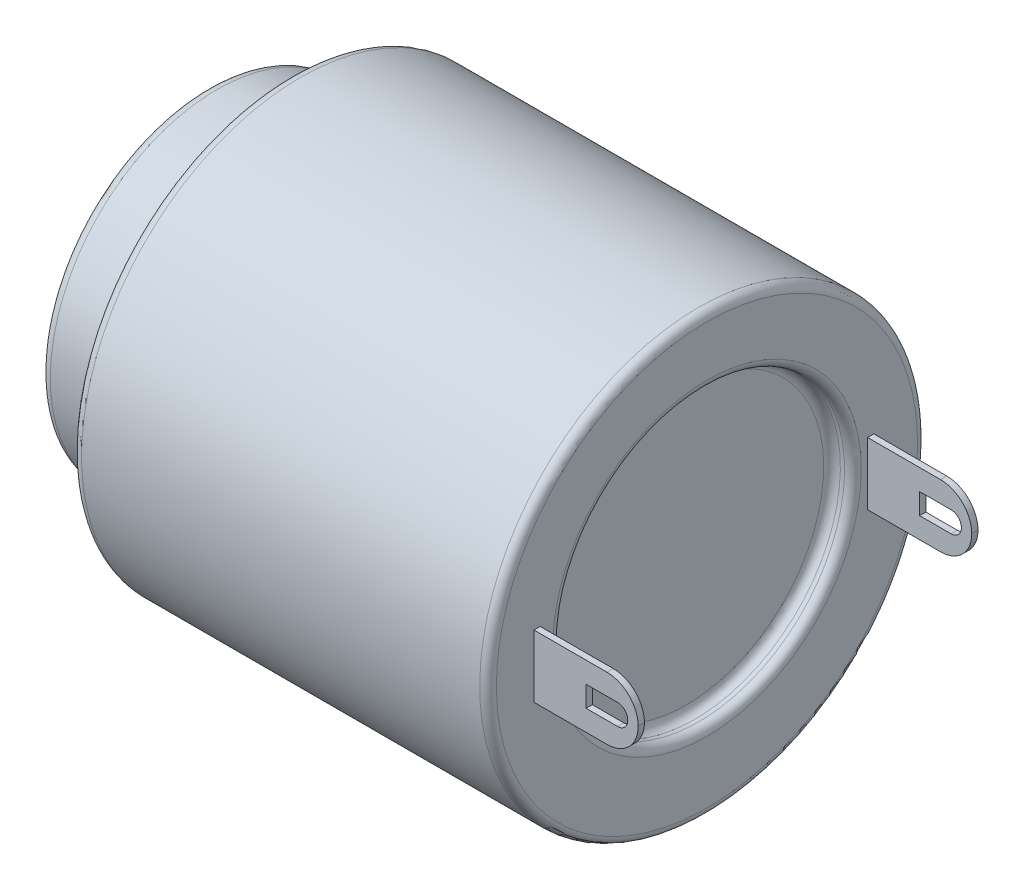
ISO-10303-21;
HEADER;
FILE_DESCRIPTION(('STEP AP214'),'2;1');
FILE_NAME('part.step','',(''),(''),'','','');
FILE_SCHEMA(('AUTOMOTIVE_DESIGN { 1 0 10303 214 1 1 1 1 }'));
ENDSEC;
DATA;
#1=APPLICATION_CONTEXT('core data for automotive mechanical design processes');
#2=APPLICATION_PROTOCOL_DEFINITION('international standard','automotive_design',2000,#1);
#3=PRODUCT_CONTEXT('',#1,'mechanical');
#4=PRODUCT('Part','Part','',(#3));
#5=PRODUCT_RELATED_PRODUCT_CATEGORY('part','',(#4));
#6=PRODUCT_DEFINITION_FORMATION('','',#4);
#7=PRODUCT_DEFINITION_CONTEXT('part definition',#1,'design');
#8=PRODUCT_DEFINITION('design','',#6,#7);
#9=PRODUCT_DEFINITION_SHAPE('','',#8);
#10=(LENGTH_UNIT() NAMED_UNIT(*) SI_UNIT(.MILLI.,.METRE.));
#11=(NAMED_UNIT(*) PLANE_ANGLE_UNIT() SI_UNIT($,.RADIAN.));
#12=(NAMED_UNIT(*) SI_UNIT($,.STERADIAN.) SOLID_ANGLE_UNIT());
#13=UNCERTAINTY_MEASURE_WITH_UNIT(LENGTH_MEASURE(1.E-05),#10,'distance_accuracy_value','');
#14=(GEOMETRIC_REPRESENTATION_CONTEXT(3) GLOBAL_UNCERTAINTY_ASSIGNED_CONTEXT((#13)) GLOBAL_UNIT_ASSIGNED_CONTEXT((#10,
#11,#12)) REPRESENTATION_CONTEXT('',''));
#15=CARTESIAN_POINT('',(0.,0.,0.));
#16=DIRECTION('',(0.,0.,1.));
#17=DIRECTION('',(1.,0.,0.));
#18=AXIS2_PLACEMENT_3D('',#15,#16,#17);
#19=CARTESIAN_POINT('',(-48.9266761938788,22.2309872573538,0.));
#20=DIRECTION('',(1.,0.,0.));
#21=DIRECTION('',(0.,1.,0.));
#22=AXIS2_PLACEMENT_3D('',#19,#20,#21);
#23=PLANE('',#22);
#24=CARTESIAN_POINT('',(-48.9266761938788,11.7309872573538,0.));
#25=DIRECTION('',(1.,0.,0.));
#26=DIRECTION('',(0.,1.,0.));
#27=AXIS2_PLACEMENT_3D('',#24,#25,#26);
#28=CIRCLE('',#27,10.1);
#29=CARTESIAN_POINT('',(-48.9266761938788,21.8309872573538,0.));
#30=VERTEX_POINT('',#29);
#31=EDGE_CURVE('E360',#30,#30,#28,.T.);
#32=ORIENTED_EDGE('',*,*,#31,.T.);
#33=EDGE_LOOP('',(#32));
#34=FACE_BOUND('',#33,.T.);
#35=CARTESIAN_POINT('',(-48.9266761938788,12.0060855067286,0.));
#36=DIRECTION('',(1.,0.,0.));
#37=DIRECTION('',(0.,1.,0.));
#38=AXIS2_PLACEMENT_3D('',#35,#36,#37);
#39=CIRCLE('',#38,7.4);
#40=CARTESIAN_POINT('',(-48.9266761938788,19.4060855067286,0.));
#41=VERTEX_POINT('',#40);
#42=EDGE_CURVE('E357',#41,#41,#39,.F.);
#43=ORIENTED_EDGE('',*,*,#42,.T.);
#44=EDGE_LOOP('',(#43));
#45=FACE_BOUND('',#44,.T.);
#46=DIRECTION('',(0.,0.,-1.));
#47=VECTOR('',#46,1.);
#48=CARTESIAN_POINT('',(-48.9266761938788,10.1746732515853,8.3));
#49=LINE('',#48,#47);
#50=CARTESIAN_POINT('',(-48.9266761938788,10.1746732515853,8.3));
#51=VERTEX_POINT('',#50);
#52=CARTESIAN_POINT('',(-48.9266761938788,10.1746732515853,8.));
#53=VERTEX_POINT('',#52);
#54=EDGE_CURVE('E283',#51,#53,#49,.T.);
#55=ORIENTED_EDGE('',*,*,#54,.F.);
#56=DIRECTION('',(0.,-1.,0.));
#57=VECTOR('',#56,1.);
#58=CARTESIAN_POINT('',(-48.9266761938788,13.1746732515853,8.3));
#59=LINE('',#58,#57);
#60=CARTESIAN_POINT('',(-48.9266761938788,13.1746732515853,8.3));
#61=VERTEX_POINT('',#60);
#62=EDGE_CURVE('E280',#61,#51,#59,.T.);
#63=ORIENTED_EDGE('',*,*,#62,.F.);
#64=DIRECTION('',(0.,0.,1.));
#65=VECTOR('',#64,1.);
#66=CARTESIAN_POINT('',(-48.9266761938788,13.1746732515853,8.3));
#67=LINE('',#66,#65);
#68=CARTESIAN_POINT('',(-48.9266761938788,13.1746732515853,8.));
#69=VERTEX_POINT('',#68);
#70=EDGE_CURVE('E289',#69,#61,#67,.T.);
#71=ORIENTED_EDGE('',*,*,#70,.F.);
#72=DIRECTION('',(0.,1.,0.));
#73=VECTOR('',#72,1.);
#74=CARTESIAN_POINT('',(-48.9266761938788,13.1746732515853,8.));
#75=LINE('',#74,#73);
#76=EDGE_CURVE('E286',#53,#69,#75,.T.);
#77=ORIENTED_EDGE('',*,*,#76,.F.);
#78=EDGE_LOOP('',(#55,#63,#71,#77));
#79=FACE_BOUND('',#78,.T.);
#80=DIRECTION('',(0.,0.,-1.));
#81=VECTOR('',#80,1.);
#82=CARTESIAN_POINT('',(-48.9266761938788,10.1746732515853,-7.7));
#83=LINE('',#82,#81);
#84=CARTESIAN_POINT('',(-48.9266761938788,10.1746732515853,-7.7));
#85=VERTEX_POINT('',#84);
#86=CARTESIAN_POINT('',(-48.9266761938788,10.1746732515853,-8.));
#87=VERTEX_POINT('',#86);
#88=EDGE_CURVE('E263',#85,#87,#83,.T.);
#89=ORIENTED_EDGE('',*,*,#88,.F.);
#90=DIRECTION('',(0.,-1.,0.));
#91=VECTOR('',#90,1.);
#92=CARTESIAN_POINT('',(-48.9266761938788,13.1746732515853,-7.7));
#93=LINE('',#92,#91);
#94=CARTESIAN_POINT('',(-48.9266761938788,13.1746732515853,-7.7));
#95=VERTEX_POINT('',#94);
#96=EDGE_CURVE('E260',#95,#85,#93,.T.);
#97=ORIENTED_EDGE('',*,*,#96,.F.);
#98=DIRECTION('',(0.,0.,1.));
#99=VECTOR('',#98,1.);
#100=CARTESIAN_POINT('',(-48.9266761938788,13.1746732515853,-7.7));
#101=LINE('',#100,#99);
#102=CARTESIAN_POINT('',(-48.9266761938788,13.1746732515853,-8.));
#103=VERTEX_POINT('',#102);
#104=EDGE_CURVE('E269',#103,#95,#101,.T.);
#105=ORIENTED_EDGE('',*,*,#104,.F.);
#106=DIRECTION('',(0.,1.,0.));
#107=VECTOR('',#106,1.);
#108=CARTESIAN_POINT('',(-48.9266761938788,13.1746732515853,-8.));
#109=LINE('',#108,#107);
#110=EDGE_CURVE('E266',#87,#103,#109,.T.);
#111=ORIENTED_EDGE('',*,*,#110,.F.);
#112=EDGE_LOOP('',(#89,#97,#105,#111));
#113=FACE_BOUND('',#112,.T.);
#114=ADVANCED_FACE('F31',(#34,#45,#79,#113),#23,.T.);
#115=CARTESIAN_POINT('',(-48.9266761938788,11.7309872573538,0.));
#116=DIRECTION('',(1.,0.,0.));
#117=DIRECTION('',(0.,1.,0.));
#118=AXIS2_PLACEMENT_3D('',#115,#116,#117);
#119=CYLINDRICAL_SURFACE('',#118,10.5);
#120=CARTESIAN_POINT('',(-49.3266761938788,11.7309872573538,0.));
#121=DIRECTION('',(1.,0.,0.));
#122=DIRECTION('',(0.,1.,0.));
#123=AXIS2_PLACEMENT_3D('',#120,#121,#122);
#124=CIRCLE('',#123,10.5);
#125=CARTESIAN_POINT('',(-49.3266761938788,22.2309872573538,0.));
#126=VERTEX_POINT('',#125);
#127=EDGE_CURVE('E363',#126,#126,#124,.F.);
#128=ORIENTED_EDGE('',*,*,#127,.T.);
#129=EDGE_LOOP('',(#128));
#130=FACE_BOUND('',#129,.T.);
#131=CARTESIAN_POINT('',(-68.4266761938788,11.7309872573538,0.));
#132=DIRECTION('',(-1.,0.,0.));
#133=DIRECTION('',(0.,-1.,0.));
#134=AXIS2_PLACEMENT_3D('',#131,#132,#133);
#135=CIRCLE('',#134,10.5);
#136=CARTESIAN_POINT('',(-68.4266761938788,1.23098725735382,0.));
#137=VERTEX_POINT('',#136);
#138=EDGE_CURVE('E345',#137,#137,#135,.F.);
#139=ORIENTED_EDGE('',*,*,#138,.T.);
#140=EDGE_LOOP('',(#139));
#141=FACE_BOUND('',#140,.T.);
#142=ADVANCED_FACE('F482',(#130,#141),#119,.T.);
#143=CARTESIAN_POINT('',(-68.9266761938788,19.7309872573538,0.));
#144=DIRECTION('',(-1.,0.,0.));
#145=DIRECTION('',(0.,-1.,0.));
#146=AXIS2_PLACEMENT_3D('',#143,#144,#145);
#147=PLANE('',#146);
#148=CARTESIAN_POINT('',(-68.9266761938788,11.7309872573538,0.));
#149=DIRECTION('',(-1.,0.,0.));
#150=DIRECTION('',(0.,-1.,0.));
#151=AXIS2_PLACEMENT_3D('',#148,#149,#150);
#152=CIRCLE('',#151,8.5);
#153=CARTESIAN_POINT('',(-68.9266761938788,3.23098725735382,0.));
#154=VERTEX_POINT('',#153);
#155=EDGE_CURVE('E342',#154,#154,#152,.F.);
#156=ORIENTED_EDGE('',*,*,#155,.T.);
#157=EDGE_LOOP('',(#156));
#158=FACE_BOUND('',#157,.T.);
#159=CARTESIAN_POINT('',(-68.9266761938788,11.7309872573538,0.));
#160=DIRECTION('',(-1.,0.,0.));
#161=DIRECTION('',(0.,-1.,0.));
#162=AXIS2_PLACEMENT_3D('',#159,#160,#161);
#163=CIRCLE('',#162,10.);
#164=CARTESIAN_POINT('',(-68.9266761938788,1.73098725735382,0.));
#165=VERTEX_POINT('',#164);
#166=EDGE_CURVE('E339',#165,#165,#163,.T.);
#167=ORIENTED_EDGE('',*,*,#166,.T.);
#168=EDGE_LOOP('',(#167));
#169=FACE_BOUND('',#168,.T.);
#170=ADVANCED_FACE('F488',(#158,#169),#147,.T.);
#171=CARTESIAN_POINT('',(-48.9266761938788,11.7309872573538,0.));
#172=DIRECTION('',(1.,0.,0.));
#173=DIRECTION('',(0.,1.,0.));
#174=AXIS2_PLACEMENT_3D('',#171,#172,#173);
#175=CYLINDRICAL_SURFACE('',#174,8.);
#176=CARTESIAN_POINT('',(-72.4266761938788,11.7309872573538,0.));
#177=DIRECTION('',(-1.,0.,0.));
#178=DIRECTION('',(0.,-1.,0.));
#179=AXIS2_PLACEMENT_3D('',#176,#177,#178);
#180=CIRCLE('',#179,8.);
#181=CARTESIAN_POINT('',(-72.4266761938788,3.73098725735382,0.));
#182=VERTEX_POINT('',#181);
#183=EDGE_CURVE('E336',#182,#182,#180,.F.);
#184=ORIENTED_EDGE('',*,*,#183,.T.);
#185=EDGE_LOOP('',(#184));
#186=FACE_BOUND('',#185,.T.);
#187=CARTESIAN_POINT('',(-69.4266761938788,11.7309872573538,0.));
#188=DIRECTION('',(-1.,0.,0.));
#189=DIRECTION('',(0.,-1.,0.));
#190=AXIS2_PLACEMENT_3D('',#187,#188,#189);
#191=CIRCLE('',#190,8.);
#192=CARTESIAN_POINT('',(-69.4266761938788,3.73098725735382,0.));
#193=VERTEX_POINT('',#192);
#194=EDGE_CURVE('E333',#193,#193,#191,.T.);
#195=ORIENTED_EDGE('',*,*,#194,.T.);
#196=EDGE_LOOP('',(#195));
#197=FACE_BOUND('',#196,.T.);
#198=ADVANCED_FACE('F650',(#186,#197),#175,.T.);
#199=CARTESIAN_POINT('',(-72.9266761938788,14.7309872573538,0.));
#200=DIRECTION('',(-1.,0.,0.));
#201=DIRECTION('',(0.,-1.,0.));
#202=AXIS2_PLACEMENT_3D('',#199,#200,#201);
#203=PLANE('',#202);
#204=CARTESIAN_POINT('',(-72.9266761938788,16.7309872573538,0.));
#205=DIRECTION('',(-1.,0.,0.));
#206=DIRECTION('',(0.,-1.,0.));
#207=AXIS2_PLACEMENT_3D('',#204,#205,#206);
#208=CIRCLE('',#207,1.);
#209=CARTESIAN_POINT('',(-72.9266761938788,15.7309872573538,0.));
#210=VERTEX_POINT('',#209);
#211=EDGE_CURVE('E300',#210,#210,#208,.T.);
#212=ORIENTED_EDGE('',*,*,#211,.F.);
#213=EDGE_LOOP('',(#212));
#214=FACE_BOUND('',#213,.T.);
#215=CARTESIAN_POINT('',(-72.9266761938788,6.23098725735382,0.));
#216=DIRECTION('',(-1.,0.,0.));
#217=DIRECTION('',(0.,-1.,0.));
#218=AXIS2_PLACEMENT_3D('',#215,#216,#217);
#219=CIRCLE('',#218,1.);
#220=CARTESIAN_POINT('',(-72.9266761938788,5.23098725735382,0.));
#221=VERTEX_POINT('',#220);
#222=EDGE_CURVE('E306',#221,#221,#219,.T.);
#223=ORIENTED_EDGE('',*,*,#222,.F.);
#224=EDGE_LOOP('',(#223));
#225=FACE_BOUND('',#224,.T.);
#226=CARTESIAN_POINT('',(-72.9266761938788,11.7309872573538,0.));
#227=DIRECTION('',(-1.,0.,0.));
#228=DIRECTION('',(0.,-1.,0.));
#229=AXIS2_PLACEMENT_3D('',#226,#227,#228);
#230=CIRCLE('',#229,3.5);
#231=CARTESIAN_POINT('',(-72.9266761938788,8.23098725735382,0.));
#232=VERTEX_POINT('',#231);
#233=EDGE_CURVE('E330',#232,#232,#230,.F.);
#234=ORIENTED_EDGE('',*,*,#233,.T.);
#235=EDGE_LOOP('',(#234));
#236=FACE_BOUND('',#235,.T.);
#237=CARTESIAN_POINT('',(-72.9266761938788,11.7309872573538,0.));
#238=DIRECTION('',(-1.,0.,0.));
#239=DIRECTION('',(0.,-1.,0.));
#240=AXIS2_PLACEMENT_3D('',#237,#238,#239);
#241=CIRCLE('',#240,7.5);
#242=CARTESIAN_POINT('',(-72.9266761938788,4.23098725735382,0.));
#243=VERTEX_POINT('',#242);
#244=EDGE_CURVE('E327',#243,#243,#241,.T.);
#245=ORIENTED_EDGE('',*,*,#244,.T.);
#246=EDGE_LOOP('',(#245));
#247=FACE_BOUND('',#246,.T.);
#248=ADVANCED_FACE('F646',(#214,#225,#236,#247),#203,.T.);
#249=CARTESIAN_POINT('',(-48.9266761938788,11.7309872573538,0.));
#250=DIRECTION('',(1.,0.,0.));
#251=DIRECTION('',(0.,1.,0.));
#252=AXIS2_PLACEMENT_3D('',#249,#250,#251);
#253=CYLINDRICAL_SURFACE('',#252,3.);
#254=CARTESIAN_POINT('',(-74.4266761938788,11.7309872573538,0.));
#255=DIRECTION('',(-1.,0.,0.));
#256=DIRECTION('',(0.,-1.,0.));
#257=AXIS2_PLACEMENT_3D('',#254,#255,#256);
#258=CIRCLE('',#257,3.);
#259=CARTESIAN_POINT('',(-74.4266761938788,8.73098725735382,0.));
#260=VERTEX_POINT('',#259);
#261=EDGE_CURVE('E321',#260,#260,#258,.F.);
#262=ORIENTED_EDGE('',*,*,#261,.T.);
#263=EDGE_LOOP('',(#262));
#264=FACE_BOUND('',#263,.T.);
#265=CARTESIAN_POINT('',(-73.4266761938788,11.7309872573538,0.));
#266=DIRECTION('',(-1.,0.,0.));
#267=DIRECTION('',(0.,-1.,0.));
#268=AXIS2_PLACEMENT_3D('',#265,#266,#267);
#269=CIRCLE('',#268,3.);
#270=CARTESIAN_POINT('',(-73.4266761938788,8.73098725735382,0.));
#271=VERTEX_POINT('',#270);
#272=EDGE_CURVE('E318',#271,#271,#269,.T.);
#273=ORIENTED_EDGE('',*,*,#272,.T.);
#274=EDGE_LOOP('',(#273));
#275=FACE_BOUND('',#274,.T.);
#276=ADVANCED_FACE('F642',(#264,#275),#253,.T.);
#277=CARTESIAN_POINT('',(-74.9266761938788,11.7309872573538,0.));
#278=DIRECTION('',(-1.,0.,0.));
#279=DIRECTION('',(0.,-1.,0.));
#280=AXIS2_PLACEMENT_3D('',#277,#278,#279);
#281=PLANE('',#280);
#282=CARTESIAN_POINT('',(-74.9266761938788,11.7309872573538,0.));
#283=DIRECTION('',(-1.,0.,0.));
#284=DIRECTION('',(0.,-1.,0.));
#285=AXIS2_PLACEMENT_3D('',#282,#283,#284);
#286=CIRCLE('',#285,1.);
#287=CARTESIAN_POINT('',(-74.9266761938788,10.7309872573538,0.));
#288=VERTEX_POINT('',#287);
#289=EDGE_CURVE('E312',#288,#288,#286,.T.);
#290=ORIENTED_EDGE('',*,*,#289,.F.);
#291=EDGE_LOOP('',(#290));
#292=FACE_BOUND('',#291,.T.);
#293=CARTESIAN_POINT('',(-74.9266761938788,11.7309872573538,0.));
#294=DIRECTION('',(-1.,0.,0.));
#295=DIRECTION('',(0.,-1.,0.));
#296=AXIS2_PLACEMENT_3D('',#293,#294,#295);
#297=CIRCLE('',#296,2.5);
#298=CARTESIAN_POINT('',(-74.9266761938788,9.23098725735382,0.));
#299=VERTEX_POINT('',#298);
#300=EDGE_CURVE('E324',#299,#299,#297,.T.);
#301=ORIENTED_EDGE('',*,*,#300,.T.);
#302=EDGE_LOOP('',(#301));
#303=FACE_BOUND('',#302,.T.);
#304=ADVANCED_FACE('F639',(#292,#303),#281,.T.);
#305=CARTESIAN_POINT('',(-74.4266761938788,11.7309872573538,0.));
#306=DIRECTION('',(-1.,0.,0.));
#307=DIRECTION('',(0.,-1.,0.));
#308=AXIS2_PLACEMENT_3D('',#305,#306,#307);
#309=TOROIDAL_SURFACE('',#308,2.5,0.5);
#310=ORIENTED_EDGE('',*,*,#300,.F.);
#311=EDGE_LOOP('',(#310));
#312=FACE_BOUND('',#311,.T.);
#313=ORIENTED_EDGE('',*,*,#261,.F.);
#314=EDGE_LOOP('',(#313));
#315=FACE_BOUND('',#314,.T.);
#316=ADVANCED_FACE('F635',(#312,#315),#309,.T.);
#317=CARTESIAN_POINT('',(-73.4266761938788,11.7309872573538,0.));
#318=DIRECTION('',(-1.,0.,0.));
#319=DIRECTION('',(0.,-1.,0.));
#320=AXIS2_PLACEMENT_3D('',#317,#318,#319);
#321=TOROIDAL_SURFACE('',#320,3.5,0.5);
#322=ORIENTED_EDGE('',*,*,#272,.F.);
#323=EDGE_LOOP('',(#322));
#324=FACE_BOUND('',#323,.T.);
#325=ORIENTED_EDGE('',*,*,#233,.F.);
#326=EDGE_LOOP('',(#325));
#327=FACE_BOUND('',#326,.T.);
#328=ADVANCED_FACE('F631',(#324,#327),#321,.F.);
#329=CARTESIAN_POINT('',(-72.4266761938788,11.7309872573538,0.));
#330=DIRECTION('',(-1.,0.,0.));
#331=DIRECTION('',(0.,-1.,0.));
#332=AXIS2_PLACEMENT_3D('',#329,#330,#331);
#333=TOROIDAL_SURFACE('',#332,7.5,0.5);
#334=ORIENTED_EDGE('',*,*,#244,.F.);
#335=EDGE_LOOP('',(#334));
#336=FACE_BOUND('',#335,.T.);
#337=ORIENTED_EDGE('',*,*,#183,.F.);
#338=EDGE_LOOP('',(#337));
#339=FACE_BOUND('',#338,.T.);
#340=ADVANCED_FACE('F623',(#336,#339),#333,.T.);
#341=CARTESIAN_POINT('',(-69.4266761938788,11.7309872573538,0.));
#342=DIRECTION('',(-1.,0.,0.));
#343=DIRECTION('',(0.,-1.,0.));
#344=AXIS2_PLACEMENT_3D('',#341,#342,#343);
#345=TOROIDAL_SURFACE('',#344,8.5,0.5);
#346=ORIENTED_EDGE('',*,*,#194,.F.);
#347=EDGE_LOOP('',(#346));
#348=FACE_BOUND('',#347,.T.);
#349=ORIENTED_EDGE('',*,*,#155,.F.);
#350=EDGE_LOOP('',(#349));
#351=FACE_BOUND('',#350,.T.);
#352=ADVANCED_FACE('F612',(#348,#351),#345,.F.);
#353=CARTESIAN_POINT('',(-68.4266761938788,11.7309872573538,0.));
#354=DIRECTION('',(-1.,0.,0.));
#355=DIRECTION('',(0.,-1.,0.));
#356=AXIS2_PLACEMENT_3D('',#353,#354,#355);
#357=TOROIDAL_SURFACE('',#356,10.,0.5);
#358=ORIENTED_EDGE('',*,*,#166,.F.);
#359=EDGE_LOOP('',(#358));
#360=FACE_BOUND('',#359,.T.);
#361=ORIENTED_EDGE('',*,*,#138,.F.);
#362=EDGE_LOOP('',(#361));
#363=FACE_BOUND('',#362,.T.);
#364=ADVANCED_FACE('F609',(#360,#363),#357,.T.);
#365=CARTESIAN_POINT('',(-64.9266761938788,11.7309872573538,0.));
#366=DIRECTION('',(-1.,0.,0.));
#367=DIRECTION('',(0.,-1.,0.));
#368=AXIS2_PLACEMENT_3D('',#365,#366,#367);
#369=CYLINDRICAL_SURFACE('',#368,1.);
#370=CARTESIAN_POINT('',(-64.9266761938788,11.7309872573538,0.));
#371=DIRECTION('',(-1.,0.,0.));
#372=DIRECTION('',(0.,-1.,0.));
#373=AXIS2_PLACEMENT_3D('',#370,#371,#372);
#374=CIRCLE('',#373,1.);
#375=CARTESIAN_POINT('',(-64.9266761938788,10.7309872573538,0.));
#376=VERTEX_POINT('',#375);
#377=EDGE_CURVE('E315',#376,#376,#374,.T.);
#378=ORIENTED_EDGE('',*,*,#377,.F.);
#379=EDGE_LOOP('',(#378));
#380=FACE_BOUND('',#379,.T.);
#381=ORIENTED_EDGE('',*,*,#289,.T.);
#382=EDGE_LOOP('',(#381));
#383=FACE_BOUND('',#382,.T.);
#384=ADVANCED_FACE('F611',(#380,#383),#369,.F.);
#385=CARTESIAN_POINT('',(-64.9266761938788,11.7309872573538,0.));
#386=DIRECTION('',(-1.,0.,0.));
#387=DIRECTION('',(0.,-1.,0.));
#388=AXIS2_PLACEMENT_3D('',#385,#386,#387);
#389=PLANE('',#388);
#390=ORIENTED_EDGE('',*,*,#377,.T.);
#391=EDGE_LOOP('',(#390));
#392=FACE_BOUND('',#391,.T.);
#393=ADVANCED_FACE('F620',(#392),#389,.T.);
#394=CARTESIAN_POINT('',(-62.9266761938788,6.23098725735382,0.));
#395=DIRECTION('',(-1.,0.,0.));
#396=DIRECTION('',(0.,-1.,0.));
#397=AXIS2_PLACEMENT_3D('',#394,#395,#396);
#398=CYLINDRICAL_SURFACE('',#397,1.);
#399=CARTESIAN_POINT('',(-62.9266761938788,6.23098725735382,0.));
#400=DIRECTION('',(-1.,0.,0.));
#401=DIRECTION('',(0.,-1.,0.));
#402=AXIS2_PLACEMENT_3D('',#399,#400,#401);
#403=CIRCLE('',#402,1.);
#404=CARTESIAN_POINT('',(-62.9266761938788,5.23098725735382,0.));
#405=VERTEX_POINT('',#404);
#406=EDGE_CURVE('E309',#405,#405,#403,.T.);
#407=ORIENTED_EDGE('',*,*,#406,.F.);
#408=EDGE_LOOP('',(#407));
#409=FACE_BOUND('',#408,.T.);
#410=ORIENTED_EDGE('',*,*,#222,.T.);
#411=EDGE_LOOP('',(#410));
#412=FACE_BOUND('',#411,.T.);
#413=ADVANCED_FACE('F702',(#409,#412),#398,.F.);
#414=CARTESIAN_POINT('',(-62.9266761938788,6.23098725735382,0.));
#415=DIRECTION('',(-1.,0.,0.));
#416=DIRECTION('',(0.,-1.,0.));
#417=AXIS2_PLACEMENT_3D('',#414,#415,#416);
#418=PLANE('',#417);
#419=ORIENTED_EDGE('',*,*,#406,.T.);
#420=EDGE_LOOP('',(#419));
#421=FACE_BOUND('',#420,.T.);
#422=ADVANCED_FACE('F709',(#421),#418,.T.);
#423=CARTESIAN_POINT('',(-62.9266761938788,16.7309872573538,0.));
#424=DIRECTION('',(-1.,0.,0.));
#425=DIRECTION('',(0.,-1.,0.));
#426=AXIS2_PLACEMENT_3D('',#423,#424,#425);
#427=CYLINDRICAL_SURFACE('',#426,1.);
#428=CARTESIAN_POINT('',(-62.9266761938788,16.7309872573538,0.));
#429=DIRECTION('',(-1.,0.,0.));
#430=DIRECTION('',(0.,-1.,0.));
#431=AXIS2_PLACEMENT_3D('',#428,#429,#430);
#432=CIRCLE('',#431,1.);
#433=CARTESIAN_POINT('',(-62.9266761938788,15.7309872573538,0.));
#434=VERTEX_POINT('',#433);
#435=EDGE_CURVE('E303',#434,#434,#432,.T.);
#436=ORIENTED_EDGE('',*,*,#435,.F.);
#437=EDGE_LOOP('',(#436));
#438=FACE_BOUND('',#437,.T.);
#439=ORIENTED_EDGE('',*,*,#211,.T.);
#440=EDGE_LOOP('',(#439));
#441=FACE_BOUND('',#440,.T.);
#442=ADVANCED_FACE('F478',(#438,#441),#427,.F.);
#443=CARTESIAN_POINT('',(-62.9266761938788,16.7309872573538,0.));
#444=DIRECTION('',(-1.,0.,0.));
#445=DIRECTION('',(0.,-1.,0.));
#446=AXIS2_PLACEMENT_3D('',#443,#444,#445);
#447=PLANE('',#446);
#448=ORIENTED_EDGE('',*,*,#435,.T.);
#449=EDGE_LOOP('',(#448));
#450=FACE_BOUND('',#449,.T.);
#451=ADVANCED_FACE('F470',(#450),#447,.T.);
#452=CARTESIAN_POINT('',(-43.9266761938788,13.1746732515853,8.3));
#453=DIRECTION('',(0.,0.,-1.));
#454=DIRECTION('',(-1.,0.,0.));
#455=AXIS2_PLACEMENT_3D('',#452,#453,#454);
#456=PLANE('',#455);
#457=DIRECTION('',(1.,0.,0.));
#458=VECTOR('',#457,1.);
#459=CARTESIAN_POINT('',(-46.4266761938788,11.1746732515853,8.3));
#460=LINE('',#459,#458);
#461=CARTESIAN_POINT('',(-46.4266761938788,11.1746732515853,8.3));
#462=VERTEX_POINT('',#461);
#463=CARTESIAN_POINT('',(-44.9166761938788,11.1746732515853,8.3));
#464=VERTEX_POINT('',#463);
#465=EDGE_CURVE('E191',#462,#464,#460,.T.);
#466=ORIENTED_EDGE('',*,*,#465,.F.);
#467=DIRECTION('',(0.,-1.,0.));
#468=VECTOR('',#467,1.);
#469=CARTESIAN_POINT('',(-46.4266761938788,12.1746732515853,8.3));
#470=LINE('',#469,#468);
#471=CARTESIAN_POINT('',(-46.4266761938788,12.1746732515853,8.3));
#472=VERTEX_POINT('',#471);
#473=EDGE_CURVE('E197',#472,#462,#470,.T.);
#474=ORIENTED_EDGE('',*,*,#473,.F.);
#475=DIRECTION('',(-1.,0.,0.));
#476=VECTOR('',#475,1.);
#477=CARTESIAN_POINT('',(-46.4266761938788,12.1746732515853,8.3));
#478=LINE('',#477,#476);
#479=CARTESIAN_POINT('',(-44.9166761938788,12.1746732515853,8.3));
#480=VERTEX_POINT('',#479);
#481=EDGE_CURVE('E211',#480,#472,#478,.T.);
#482=ORIENTED_EDGE('',*,*,#481,.F.);
#483=CARTESIAN_POINT('',(-44.9166761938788,11.6846732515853,8.3));
#484=DIRECTION('',(0.,0.,1.));
#485=DIRECTION('',(-1.,0.,0.));
#486=AXIS2_PLACEMENT_3D('',#483,#484,#485);
#487=CIRCLE('',#486,0.489999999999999);
#488=CARTESIAN_POINT('',(-44.4266761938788,11.6846732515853,8.3));
#489=VERTEX_POINT('',#488);
#490=EDGE_CURVE('E205',#489,#480,#487,.T.);
#491=ORIENTED_EDGE('',*,*,#490,.F.);
#492=DIRECTION('',(0.,1.,0.));
#493=VECTOR('',#492,1.);
#494=CARTESIAN_POINT('',(-44.4266761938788,11.6846732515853,8.3));
#495=LINE('',#494,#493);
#496=CARTESIAN_POINT('',(-44.4266761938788,11.6646732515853,8.3));
#497=VERTEX_POINT('',#496);
#498=EDGE_CURVE('E203',#497,#489,#495,.T.);
#499=ORIENTED_EDGE('',*,*,#498,.F.);
#500=CARTESIAN_POINT('',(-44.9166761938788,11.6646732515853,8.3));
#501=DIRECTION('',(0.,0.,1.));
#502=DIRECTION('',(1.,0.,0.));
#503=AXIS2_PLACEMENT_3D('',#500,#501,#502);
#504=CIRCLE('',#503,0.489999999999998);
#505=EDGE_CURVE('E180',#464,#497,#504,.T.);
#506=ORIENTED_EDGE('',*,*,#505,.F.);
#507=EDGE_LOOP('',(#466,#474,#482,#491,#499,#506));
#508=FACE_BOUND('',#507,.T.);
#509=CARTESIAN_POINT('',(-45.4266761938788,11.6746732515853,8.3));
#510=DIRECTION('',(0.,0.,-1.));
#511=DIRECTION('',(-1.,0.,0.));
#512=AXIS2_PLACEMENT_3D('',#509,#510,#511);
#513=CIRCLE('',#512,1.5);
#514=CARTESIAN_POINT('',(-45.4266761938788,10.1746732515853,8.3));
#515=VERTEX_POINT('',#514);
#516=CARTESIAN_POINT('',(-43.9266761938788,11.6746732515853,8.3));
#517=VERTEX_POINT('',#516);
#518=EDGE_CURVE('E384',#515,#517,#513,.F.);
#519=ORIENTED_EDGE('',*,*,#518,.T.);
#520=CARTESIAN_POINT('',(-45.4266761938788,11.6746732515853,8.3));
#521=DIRECTION('',(0.,0.,-1.));
#522=DIRECTION('',(-1.,0.,0.));
#523=AXIS2_PLACEMENT_3D('',#520,#521,#522);
#524=CIRCLE('',#523,1.5);
#525=CARTESIAN_POINT('',(-45.4266761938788,13.1746732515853,8.3));
#526=VERTEX_POINT('',#525);
#527=EDGE_CURVE('E386',#517,#526,#524,.F.);
#528=ORIENTED_EDGE('',*,*,#527,.T.);
#529=DIRECTION('',(-1.,0.,0.));
#530=VECTOR('',#529,1.);
#531=CARTESIAN_POINT('',(-43.9266761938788,13.1746732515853,8.3));
#532=LINE('',#531,#530);
#533=EDGE_CURVE('E292',#526,#61,#532,.T.);
#534=ORIENTED_EDGE('',*,*,#533,.T.);
#535=ORIENTED_EDGE('',*,*,#62,.T.);
#536=DIRECTION('',(-1.,0.,0.));
#537=VECTOR('',#536,1.);
#538=CARTESIAN_POINT('',(-43.9266761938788,10.1746732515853,8.3));
#539=LINE('',#538,#537);
#540=EDGE_CURVE('E298',#515,#51,#539,.T.);
#541=ORIENTED_EDGE('',*,*,#540,.F.);
#542=EDGE_LOOP('',(#519,#528,#534,#535,#541));
#543=FACE_BOUND('',#542,.T.);
#544=ADVANCED_FACE('F199',(#508,#543),#456,.F.);
#545=CARTESIAN_POINT('',(-43.9266761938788,10.1746732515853,8.3));
#546=DIRECTION('',(0.,1.,0.));
#547=DIRECTION('',(0.,0.,1.));
#548=AXIS2_PLACEMENT_3D('',#545,#546,#547);
#549=PLANE('',#548);
#550=DIRECTION('',(-1.,0.,0.));
#551=VECTOR('',#550,1.);
#552=CARTESIAN_POINT('',(-43.9266761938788,10.1746732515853,8.));
#553=LINE('',#552,#551);
#554=CARTESIAN_POINT('',(-45.4266761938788,10.1746732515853,8.));
#555=VERTEX_POINT('',#554);
#556=EDGE_CURVE('E296',#555,#53,#553,.T.);
#557=ORIENTED_EDGE('',*,*,#556,.F.);
#558=DIRECTION('',(0.,0.,-1.));
#559=VECTOR('',#558,1.);
#560=CARTESIAN_POINT('',(-45.4266761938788,10.1746732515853,8.3));
#561=LINE('',#560,#559);
#562=EDGE_CURVE('E395',#555,#515,#561,.F.);
#563=ORIENTED_EDGE('',*,*,#562,.T.);
#564=ORIENTED_EDGE('',*,*,#540,.T.);
#565=ORIENTED_EDGE('',*,*,#54,.T.);
#566=EDGE_LOOP('',(#557,#563,#564,#565));
#567=FACE_BOUND('',#566,.T.);
#568=ADVANCED_FACE('F446',(#567),#549,.F.);
#569=CARTESIAN_POINT('',(-43.9266761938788,13.1746732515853,8.));
#570=DIRECTION('',(0.,0.,1.));
#571=DIRECTION('',(1.,0.,0.));
#572=AXIS2_PLACEMENT_3D('',#569,#570,#571);
#573=PLANE('',#572);
#574=DIRECTION('',(-1.,0.,0.));
#575=VECTOR('',#574,1.);
#576=CARTESIAN_POINT('',(-43.9266761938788,12.1746732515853,8.));
#577=LINE('',#576,#575);
#578=CARTESIAN_POINT('',(-44.9166761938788,12.1746732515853,8.));
#579=VERTEX_POINT('',#578);
#580=CARTESIAN_POINT('',(-46.4266761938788,12.1746732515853,8.));
#581=VERTEX_POINT('',#580);
#582=EDGE_CURVE('E251',#579,#581,#577,.T.);
#583=ORIENTED_EDGE('',*,*,#582,.T.);
#584=DIRECTION('',(0.,-1.,0.));
#585=VECTOR('',#584,1.);
#586=CARTESIAN_POINT('',(-46.4266761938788,13.1746732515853,8.));
#587=LINE('',#586,#585);
#588=CARTESIAN_POINT('',(-46.4266761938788,11.1746732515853,8.));
#589=VERTEX_POINT('',#588);
#590=EDGE_CURVE('E257',#581,#589,#587,.T.);
#591=ORIENTED_EDGE('',*,*,#590,.T.);
#592=DIRECTION('',(1.,0.,0.));
#593=VECTOR('',#592,1.);
#594=CARTESIAN_POINT('',(-43.9266761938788,11.1746732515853,8.));
#595=LINE('',#594,#593);
#596=CARTESIAN_POINT('',(-44.9166761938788,11.1746732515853,8.));
#597=VERTEX_POINT('',#596);
#598=EDGE_CURVE('E230',#589,#597,#595,.T.);
#599=ORIENTED_EDGE('',*,*,#598,.T.);
#600=CARTESIAN_POINT('',(-44.9166761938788,11.6646732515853,8.));
#601=DIRECTION('',(0.,0.,1.));
#602=DIRECTION('',(1.,0.,0.));
#603=AXIS2_PLACEMENT_3D('',#600,#601,#602);
#604=CIRCLE('',#603,0.489999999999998);
#605=CARTESIAN_POINT('',(-44.4266761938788,11.6646732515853,8.));
#606=VERTEX_POINT('',#605);
#607=EDGE_CURVE('E183',#597,#606,#604,.T.);
#608=ORIENTED_EDGE('',*,*,#607,.T.);
#609=DIRECTION('',(0.,1.,0.));
#610=VECTOR('',#609,1.);
#611=CARTESIAN_POINT('',(-44.4266761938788,13.1746732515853,8.));
#612=LINE('',#611,#610);
#613=CARTESIAN_POINT('',(-44.4266761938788,11.6846732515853,8.));
#614=VERTEX_POINT('',#613);
#615=EDGE_CURVE('E239',#606,#614,#612,.T.);
#616=ORIENTED_EDGE('',*,*,#615,.T.);
#617=CARTESIAN_POINT('',(-44.9166761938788,11.6846732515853,8.));
#618=DIRECTION('',(0.,0.,1.));
#619=DIRECTION('',(1.,0.,0.));
#620=AXIS2_PLACEMENT_3D('',#617,#618,#619);
#621=CIRCLE('',#620,0.489999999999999);
#622=EDGE_CURVE('E245',#614,#579,#621,.T.);
#623=ORIENTED_EDGE('',*,*,#622,.T.);
#624=EDGE_LOOP('',(#583,#591,#599,#608,#616,#623));
#625=FACE_BOUND('',#624,.T.);
#626=DIRECTION('',(-1.,0.,0.));
#627=VECTOR('',#626,1.);
#628=CARTESIAN_POINT('',(-43.9266761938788,13.1746732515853,8.));
#629=LINE('',#628,#627);
#630=CARTESIAN_POINT('',(-45.4266761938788,13.1746732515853,8.));
#631=VERTEX_POINT('',#630);
#632=EDGE_CURVE('E294',#631,#69,#629,.T.);
#633=ORIENTED_EDGE('',*,*,#632,.F.);
#634=CARTESIAN_POINT('',(-45.4266761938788,11.6746732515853,8.));
#635=DIRECTION('',(0.,0.,1.));
#636=DIRECTION('',(1.,0.,0.));
#637=AXIS2_PLACEMENT_3D('',#634,#635,#636);
#638=CIRCLE('',#637,1.5);
#639=CARTESIAN_POINT('',(-43.9266761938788,11.6746732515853,8.));
#640=VERTEX_POINT('',#639);
#641=EDGE_CURVE('E393',#631,#640,#638,.F.);
#642=ORIENTED_EDGE('',*,*,#641,.T.);
#643=CARTESIAN_POINT('',(-45.4266761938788,11.6746732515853,8.));
#644=DIRECTION('',(0.,0.,1.));
#645=DIRECTION('',(1.,0.,0.));
#646=AXIS2_PLACEMENT_3D('',#643,#644,#645);
#647=CIRCLE('',#646,1.5);
#648=EDGE_CURVE('E391',#640,#555,#647,.F.);
#649=ORIENTED_EDGE('',*,*,#648,.T.);
#650=ORIENTED_EDGE('',*,*,#556,.T.);
#651=ORIENTED_EDGE('',*,*,#76,.T.);
#652=EDGE_LOOP('',(#633,#642,#649,#650,#651));
#653=FACE_BOUND('',#652,.T.);
#654=ADVANCED_FACE('F442',(#625,#653),#573,.F.);
#655=CARTESIAN_POINT('',(-43.9266761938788,13.1746732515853,8.3));
#656=DIRECTION('',(0.,-1.,0.));
#657=DIRECTION('',(1.,0.,0.));
#658=AXIS2_PLACEMENT_3D('',#655,#656,#657);
#659=PLANE('',#658);
#660=ORIENTED_EDGE('',*,*,#533,.F.);
#661=DIRECTION('',(0.,0.,1.));
#662=VECTOR('',#661,1.);
#663=CARTESIAN_POINT('',(-45.4266761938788,13.1746732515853,8.));
#664=LINE('',#663,#662);
#665=EDGE_CURVE('E388',#526,#631,#664,.F.);
#666=ORIENTED_EDGE('',*,*,#665,.T.);
#667=ORIENTED_EDGE('',*,*,#632,.T.);
#668=ORIENTED_EDGE('',*,*,#70,.T.);
#669=EDGE_LOOP('',(#660,#666,#667,#668));
#670=FACE_BOUND('',#669,.T.);
#671=ADVANCED_FACE('F445',(#670),#659,.F.);
#672=CARTESIAN_POINT('',(-43.9266761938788,13.1746732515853,-7.7));
#673=DIRECTION('',(0.,0.,-1.));
#674=DIRECTION('',(-1.,0.,0.));
#675=AXIS2_PLACEMENT_3D('',#672,#673,#674);
#676=PLANE('',#675);
#677=DIRECTION('',(-1.,0.,0.));
#678=VECTOR('',#677,1.);
#679=CARTESIAN_POINT('',(-43.9266761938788,11.1746732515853,-7.7));
#680=LINE('',#679,#678);
#681=CARTESIAN_POINT('',(-44.9166761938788,11.1746732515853,-7.7));
#682=VERTEX_POINT('',#681);
#683=CARTESIAN_POINT('',(-46.4266761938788,11.1746732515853,-7.7));
#684=VERTEX_POINT('',#683);
#685=EDGE_CURVE('E227',#682,#684,#680,.T.);
#686=ORIENTED_EDGE('',*,*,#685,.T.);
#687=DIRECTION('',(0.,1.,0.));
#688=VECTOR('',#687,1.);
#689=CARTESIAN_POINT('',(-46.4266761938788,13.1746732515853,-7.7));
#690=LINE('',#689,#688);
#691=CARTESIAN_POINT('',(-46.4266761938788,12.1746732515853,-7.7));
#692=VERTEX_POINT('',#691);
#693=EDGE_CURVE('E254',#684,#692,#690,.T.);
#694=ORIENTED_EDGE('',*,*,#693,.T.);
#695=DIRECTION('',(1.,0.,0.));
#696=VECTOR('',#695,1.);
#697=CARTESIAN_POINT('',(-43.9266761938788,12.1746732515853,-7.7));
#698=LINE('',#697,#696);
#699=CARTESIAN_POINT('',(-44.9166761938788,12.1746732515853,-7.7));
#700=VERTEX_POINT('',#699);
#701=EDGE_CURVE('E248',#692,#700,#698,.T.);
#702=ORIENTED_EDGE('',*,*,#701,.T.);
#703=CARTESIAN_POINT('',(-44.9166761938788,11.6846732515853,-7.7));
#704=DIRECTION('',(0.,0.,-1.));
#705=DIRECTION('',(-1.,0.,0.));
#706=AXIS2_PLACEMENT_3D('',#703,#704,#705);
#707=CIRCLE('',#706,0.489999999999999);
#708=CARTESIAN_POINT('',(-44.4266761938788,11.6846732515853,-7.7));
#709=VERTEX_POINT('',#708);
#710=EDGE_CURVE('E242',#700,#709,#707,.T.);
#711=ORIENTED_EDGE('',*,*,#710,.T.);
#712=DIRECTION('',(0.,-1.,0.));
#713=VECTOR('',#712,1.);
#714=CARTESIAN_POINT('',(-44.4266761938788,13.1746732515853,-7.7));
#715=LINE('',#714,#713);
#716=CARTESIAN_POINT('',(-44.4266761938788,11.6646732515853,-7.7));
#717=VERTEX_POINT('',#716);
#718=EDGE_CURVE('E236',#709,#717,#715,.T.);
#719=ORIENTED_EDGE('',*,*,#718,.T.);
#720=CARTESIAN_POINT('',(-44.9166761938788,11.6646732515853,-7.7));
#721=DIRECTION('',(0.,0.,-1.));
#722=DIRECTION('',(-1.,0.,0.));
#723=AXIS2_PLACEMENT_3D('',#720,#721,#722);
#724=CIRCLE('',#723,0.489999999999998);
#725=EDGE_CURVE('E232',#717,#682,#724,.T.);
#726=ORIENTED_EDGE('',*,*,#725,.T.);
#727=EDGE_LOOP('',(#686,#694,#702,#711,#719,#726));
#728=FACE_BOUND('',#727,.T.);
#729=DIRECTION('',(-1.,0.,0.));
#730=VECTOR('',#729,1.);
#731=CARTESIAN_POINT('',(-43.9266761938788,10.1746732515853,-7.7));
#732=LINE('',#731,#730);
#733=CARTESIAN_POINT('',(-45.4266761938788,10.1746732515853,-7.7));
#734=VERTEX_POINT('',#733);
#735=EDGE_CURVE('E278',#734,#85,#732,.T.);
#736=ORIENTED_EDGE('',*,*,#735,.F.);
#737=CARTESIAN_POINT('',(-45.4266761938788,11.6746732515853,-7.7));
#738=DIRECTION('',(0.,0.,-1.));
#739=DIRECTION('',(-1.,0.,0.));
#740=AXIS2_PLACEMENT_3D('',#737,#738,#739);
#741=CIRCLE('',#740,1.5);
#742=CARTESIAN_POINT('',(-43.9266761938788,11.6746732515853,-7.7));
#743=VERTEX_POINT('',#742);
#744=EDGE_CURVE('E38',#734,#743,#741,.F.);
#745=ORIENTED_EDGE('',*,*,#744,.T.);
#746=CARTESIAN_POINT('',(-45.4266761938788,11.6746732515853,-7.7));
#747=DIRECTION('',(0.,0.,-1.));
#748=DIRECTION('',(-1.,0.,0.));
#749=AXIS2_PLACEMENT_3D('',#746,#747,#748);
#750=CIRCLE('',#749,1.5);
#751=CARTESIAN_POINT('',(-45.4266761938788,13.1746732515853,-7.7));
#752=VERTEX_POINT('',#751);
#753=EDGE_CURVE('E45',#743,#752,#750,.F.);
#754=ORIENTED_EDGE('',*,*,#753,.T.);
#755=DIRECTION('',(-1.,0.,0.));
#756=VECTOR('',#755,1.);
#757=CARTESIAN_POINT('',(-43.9266761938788,13.1746732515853,-7.7));
#758=LINE('',#757,#756);
#759=EDGE_CURVE('E272',#752,#95,#758,.T.);
#760=ORIENTED_EDGE('',*,*,#759,.T.);
#761=ORIENTED_EDGE('',*,*,#96,.T.);
#762=EDGE_LOOP('',(#736,#745,#754,#760,#761));
#763=FACE_BOUND('',#762,.T.);
#764=ADVANCED_FACE('F410',(#728,#763),#676,.F.);
#765=CARTESIAN_POINT('',(-43.9266761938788,10.1746732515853,-7.7));
#766=DIRECTION('',(0.,1.,0.));
#767=DIRECTION('',(0.,0.,1.));
#768=AXIS2_PLACEMENT_3D('',#765,#766,#767);
#769=PLANE('',#768);
#770=DIRECTION('',(-1.,0.,0.));
#771=VECTOR('',#770,1.);
#772=CARTESIAN_POINT('',(-43.9266761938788,10.1746732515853,-8.));
#773=LINE('',#772,#771);
#774=CARTESIAN_POINT('',(-45.4266761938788,10.1746732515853,-8.));
#775=VERTEX_POINT('',#774);
#776=EDGE_CURVE('E276',#775,#87,#773,.T.);
#777=ORIENTED_EDGE('',*,*,#776,.F.);
#778=DIRECTION('',(0.,0.,-1.));
#779=VECTOR('',#778,1.);
#780=CARTESIAN_POINT('',(-45.4266761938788,10.1746732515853,-7.7));
#781=LINE('',#780,#779);
#782=EDGE_CURVE('E401',#775,#734,#781,.F.);
#783=ORIENTED_EDGE('',*,*,#782,.T.);
#784=ORIENTED_EDGE('',*,*,#735,.T.);
#785=ORIENTED_EDGE('',*,*,#88,.T.);
#786=EDGE_LOOP('',(#777,#783,#784,#785));
#787=FACE_BOUND('',#786,.T.);
#788=ADVANCED_FACE('F407',(#787),#769,.F.);
#789=CARTESIAN_POINT('',(-43.9266761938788,13.1746732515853,-8.));
#790=DIRECTION('',(0.,0.,1.));
#791=DIRECTION('',(1.,0.,0.));
#792=AXIS2_PLACEMENT_3D('',#789,#790,#791);
#793=PLANE('',#792);
#794=DIRECTION('',(-1.,0.,0.));
#795=VECTOR('',#794,1.);
#796=CARTESIAN_POINT('',(-43.9266761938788,12.1746732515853,-8.));
#797=LINE('',#796,#795);
#798=CARTESIAN_POINT('',(-44.9166761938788,12.1746732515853,-8.));
#799=VERTEX_POINT('',#798);
#800=CARTESIAN_POINT('',(-46.4266761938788,12.1746732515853,-8.));
#801=VERTEX_POINT('',#800);
#802=EDGE_CURVE('E378',#799,#801,#797,.T.);
#803=ORIENTED_EDGE('',*,*,#802,.T.);
#804=DIRECTION('',(0.,-1.,0.));
#805=VECTOR('',#804,1.);
#806=CARTESIAN_POINT('',(-46.4266761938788,13.1746732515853,-8.));
#807=LINE('',#806,#805);
#808=CARTESIAN_POINT('',(-46.4266761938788,11.1746732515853,-8.));
#809=VERTEX_POINT('',#808);
#810=EDGE_CURVE('E381',#801,#809,#807,.T.);
#811=ORIENTED_EDGE('',*,*,#810,.T.);
#812=DIRECTION('',(1.,0.,0.));
#813=VECTOR('',#812,1.);
#814=CARTESIAN_POINT('',(-43.9266761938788,11.1746732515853,-8.));
#815=LINE('',#814,#813);
#816=CARTESIAN_POINT('',(-44.9166761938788,11.1746732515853,-8.));
#817=VERTEX_POINT('',#816);
#818=EDGE_CURVE('E366',#809,#817,#815,.T.);
#819=ORIENTED_EDGE('',*,*,#818,.T.);
#820=CARTESIAN_POINT('',(-44.9166761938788,11.6646732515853,-8.));
#821=DIRECTION('',(0.,0.,1.));
#822=DIRECTION('',(1.,0.,0.));
#823=AXIS2_PLACEMENT_3D('',#820,#821,#822);
#824=CIRCLE('',#823,0.489999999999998);
#825=CARTESIAN_POINT('',(-44.4266761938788,11.6646732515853,-8.));
#826=VERTEX_POINT('',#825);
#827=EDGE_CURVE('E369',#817,#826,#824,.T.);
#828=ORIENTED_EDGE('',*,*,#827,.T.);
#829=DIRECTION('',(0.,1.,0.));
#830=VECTOR('',#829,1.);
#831=CARTESIAN_POINT('',(-44.4266761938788,13.1746732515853,-8.));
#832=LINE('',#831,#830);
#833=CARTESIAN_POINT('',(-44.4266761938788,11.6846732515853,-8.));
#834=VERTEX_POINT('',#833);
#835=EDGE_CURVE('E372',#826,#834,#832,.T.);
#836=ORIENTED_EDGE('',*,*,#835,.T.);
#837=CARTESIAN_POINT('',(-44.9166761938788,11.6846732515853,-8.));
#838=DIRECTION('',(0.,0.,1.));
#839=DIRECTION('',(1.,0.,0.));
#840=AXIS2_PLACEMENT_3D('',#837,#838,#839);
#841=CIRCLE('',#840,0.489999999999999);
#842=EDGE_CURVE('E375',#834,#799,#841,.T.);
#843=ORIENTED_EDGE('',*,*,#842,.T.);
#844=EDGE_LOOP('',(#803,#811,#819,#828,#836,#843));
#845=FACE_BOUND('',#844,.T.);
#846=CARTESIAN_POINT('',(-45.4266761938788,11.6746732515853,-8.));
#847=DIRECTION('',(0.,0.,1.));
#848=DIRECTION('',(1.,0.,0.));
#849=AXIS2_PLACEMENT_3D('',#846,#847,#848);
#850=CIRCLE('',#849,1.5);
#851=CARTESIAN_POINT('',(-45.4266761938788,13.1746732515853,-8.));
#852=VERTEX_POINT('',#851);
#853=CARTESIAN_POINT('',(-43.9266761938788,11.6746732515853,-8.));
#854=VERTEX_POINT('',#853);
#855=EDGE_CURVE('E397',#852,#854,#850,.F.);
#856=ORIENTED_EDGE('',*,*,#855,.T.);
#857=CARTESIAN_POINT('',(-45.4266761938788,11.6746732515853,-8.));
#858=DIRECTION('',(0.,0.,1.));
#859=DIRECTION('',(1.,0.,0.));
#860=AXIS2_PLACEMENT_3D('',#857,#858,#859);
#861=CIRCLE('',#860,1.5);
#862=EDGE_CURVE('E399',#854,#775,#861,.F.);
#863=ORIENTED_EDGE('',*,*,#862,.T.);
#864=ORIENTED_EDGE('',*,*,#776,.T.);
#865=ORIENTED_EDGE('',*,*,#110,.T.);
#866=DIRECTION('',(-1.,0.,0.));
#867=VECTOR('',#866,1.);
#868=CARTESIAN_POINT('',(-43.9266761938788,13.1746732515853,-8.));
#869=LINE('',#868,#867);
#870=EDGE_CURVE('E274',#852,#103,#869,.T.);
#871=ORIENTED_EDGE('',*,*,#870,.F.);
#872=EDGE_LOOP('',(#856,#863,#864,#865,#871));
#873=FACE_BOUND('',#872,.T.);
#874=ADVANCED_FACE('F418',(#845,#873),#793,.F.);
#875=CARTESIAN_POINT('',(-43.9266761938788,13.1746732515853,-7.7));
#876=DIRECTION('',(0.,-1.,0.));
#877=DIRECTION('',(1.,0.,0.));
#878=AXIS2_PLACEMENT_3D('',#875,#876,#877);
#879=PLANE('',#878);
#880=ORIENTED_EDGE('',*,*,#759,.F.);
#881=DIRECTION('',(0.,0.,1.));
#882=VECTOR('',#881,1.);
#883=CARTESIAN_POINT('',(-45.4266761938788,13.1746732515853,-8.));
#884=LINE('',#883,#882);
#885=EDGE_CURVE('E11',#752,#852,#884,.F.);
#886=ORIENTED_EDGE('',*,*,#885,.T.);
#887=ORIENTED_EDGE('',*,*,#870,.T.);
#888=ORIENTED_EDGE('',*,*,#104,.T.);
#889=EDGE_LOOP('',(#880,#886,#887,#888));
#890=FACE_BOUND('',#889,.T.);
#891=ADVANCED_FACE('F505',(#890),#879,.F.);
#892=CARTESIAN_POINT('',(-49.9266761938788,12.0060855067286,0.));
#893=DIRECTION('',(1.,0.,0.));
#894=DIRECTION('',(0.,1.,0.));
#895=AXIS2_PLACEMENT_3D('',#892,#893,#894);
#896=CYLINDRICAL_SURFACE('',#895,7.);
#897=CARTESIAN_POINT('',(-49.3266761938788,12.0060855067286,0.));
#898=DIRECTION('',(1.,0.,0.));
#899=DIRECTION('',(0.,1.,0.));
#900=AXIS2_PLACEMENT_3D('',#897,#898,#899);
#901=CIRCLE('',#900,7.);
#902=CARTESIAN_POINT('',(-49.3266761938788,19.0060855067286,0.));
#903=VERTEX_POINT('',#902);
#904=EDGE_CURVE('E354',#903,#903,#901,.T.);
#905=ORIENTED_EDGE('',*,*,#904,.T.);
#906=EDGE_LOOP('',(#905));
#907=FACE_BOUND('',#906,.T.);
#908=CARTESIAN_POINT('',(-49.5266761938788,12.0060855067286,0.));
#909=DIRECTION('',(1.,0.,0.));
#910=DIRECTION('',(0.,1.,0.));
#911=AXIS2_PLACEMENT_3D('',#908,#909,#910);
#912=CIRCLE('',#911,7.);
#913=CARTESIAN_POINT('',(-49.5266761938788,19.0060855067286,0.));
#914=VERTEX_POINT('',#913);
#915=EDGE_CURVE('E351',#914,#914,#912,.F.);
#916=ORIENTED_EDGE('',*,*,#915,.T.);
#917=EDGE_LOOP('',(#916));
#918=FACE_BOUND('',#917,.T.);
#919=ADVANCED_FACE('F501',(#907,#918),#896,.F.);
#920=CARTESIAN_POINT('',(-49.9266761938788,12.0060855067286,0.));
#921=DIRECTION('',(1.,0.,0.));
#922=DIRECTION('',(0.,1.,0.));
#923=AXIS2_PLACEMENT_3D('',#920,#921,#922);
#924=PLANE('',#923);
#925=CARTESIAN_POINT('',(-49.9266761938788,12.0060855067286,0.));
#926=DIRECTION('',(1.,0.,0.));
#927=DIRECTION('',(0.,1.,0.));
#928=AXIS2_PLACEMENT_3D('',#925,#926,#927);
#929=CIRCLE('',#928,6.6);
#930=CARTESIAN_POINT('',(-49.9266761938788,18.6060855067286,0.));
#931=VERTEX_POINT('',#930);
#932=EDGE_CURVE('E348',#931,#931,#929,.T.);
#933=ORIENTED_EDGE('',*,*,#932,.T.);
#934=EDGE_LOOP('',(#933));
#935=FACE_BOUND('',#934,.T.);
#936=ADVANCED_FACE('F504',(#935),#924,.T.);
#937=CARTESIAN_POINT('',(-49.5266761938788,12.0060855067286,0.));
#938=DIRECTION('',(1.,0.,0.));
#939=DIRECTION('',(0.,1.,0.));
#940=AXIS2_PLACEMENT_3D('',#937,#938,#939);
#941=TOROIDAL_SURFACE('',#940,6.6,0.4);
#942=ORIENTED_EDGE('',*,*,#915,.F.);
#943=EDGE_LOOP('',(#942));
#944=FACE_BOUND('',#943,.T.);
#945=ORIENTED_EDGE('',*,*,#932,.F.);
#946=EDGE_LOOP('',(#945));
#947=FACE_BOUND('',#946,.T.);
#948=ADVANCED_FACE('F497',(#944,#947),#941,.F.);
#949=CARTESIAN_POINT('',(-49.3266761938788,12.0060855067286,0.));
#950=DIRECTION('',(1.,0.,0.));
#951=DIRECTION('',(0.,1.,0.));
#952=AXIS2_PLACEMENT_3D('',#949,#950,#951);
#953=TOROIDAL_SURFACE('',#952,7.4,0.4);
#954=ORIENTED_EDGE('',*,*,#42,.F.);
#955=EDGE_LOOP('',(#954));
#956=FACE_BOUND('',#955,.T.);
#957=ORIENTED_EDGE('',*,*,#904,.F.);
#958=EDGE_LOOP('',(#957));
#959=FACE_BOUND('',#958,.T.);
#960=ADVANCED_FACE('F494',(#956,#959),#953,.T.);
#961=CARTESIAN_POINT('',(-49.3266761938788,11.7309872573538,0.));
#962=DIRECTION('',(1.,0.,0.));
#963=DIRECTION('',(0.,1.,0.));
#964=AXIS2_PLACEMENT_3D('',#961,#962,#963);
#965=TOROIDAL_SURFACE('',#964,10.1,0.4);
#966=ORIENTED_EDGE('',*,*,#127,.F.);
#967=EDGE_LOOP('',(#966));
#968=FACE_BOUND('',#967,.T.);
#969=ORIENTED_EDGE('',*,*,#31,.F.);
#970=EDGE_LOOP('',(#969));
#971=FACE_BOUND('',#970,.T.);
#972=ADVANCED_FACE('F496',(#968,#971),#965,.T.);
#973=CARTESIAN_POINT('',(-46.4266761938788,11.1746732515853,-10.5));
#974=DIRECTION('',(0.,-1.,0.));
#975=DIRECTION('',(1.,0.,0.));
#976=AXIS2_PLACEMENT_3D('',#973,#974,#975);
#977=PLANE('',#976);
#978=DIRECTION('',(0.,0.,1.));
#979=VECTOR('',#978,1.);
#980=CARTESIAN_POINT('',(-44.9166761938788,11.1746732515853,-10.5));
#981=LINE('',#980,#979);
#982=EDGE_CURVE('E186',#817,#682,#981,.T.);
#983=ORIENTED_EDGE('',*,*,#982,.F.);
#984=ORIENTED_EDGE('',*,*,#818,.F.);
#985=DIRECTION('',(0.,0.,1.));
#986=VECTOR('',#985,1.);
#987=CARTESIAN_POINT('',(-46.4266761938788,11.1746732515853,-10.5));
#988=LINE('',#987,#986);
#989=EDGE_CURVE('E187',#809,#684,#988,.T.);
#990=ORIENTED_EDGE('',*,*,#989,.T.);
#991=ORIENTED_EDGE('',*,*,#685,.F.);
#992=EDGE_LOOP('',(#983,#984,#990,#991));
#993=FACE_BOUND('',#992,.T.);
#994=ADVANCED_FACE('F594',(#993),#977,.F.);
#995=CARTESIAN_POINT('',(-44.9166761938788,11.6646732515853,-10.5));
#996=DIRECTION('',(0.,0.,1.));
#997=DIRECTION('',(1.,0.,0.));
#998=AXIS2_PLACEMENT_3D('',#995,#996,#997);
#999=CYLINDRICAL_SURFACE('',#998,0.489999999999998);
#1000=DIRECTION('',(0.,0.,1.));
#1001=VECTOR('',#1000,1.);
#1002=CARTESIAN_POINT('',(-44.4266761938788,11.6646732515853,-10.5));
#1003=LINE('',#1002,#1001);
#1004=EDGE_CURVE('E223',#826,#717,#1003,.T.);
#1005=ORIENTED_EDGE('',*,*,#1004,.F.);
#1006=ORIENTED_EDGE('',*,*,#827,.F.);
#1007=ORIENTED_EDGE('',*,*,#982,.T.);
#1008=ORIENTED_EDGE('',*,*,#725,.F.);
#1009=EDGE_LOOP('',(#1005,#1006,#1007,#1008));
#1010=FACE_BOUND('',#1009,.T.);
#1011=ADVANCED_FACE('F592',(#1010),#999,.F.);
#1012=CARTESIAN_POINT('',(-44.4266761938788,11.6846732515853,-10.5));
#1013=DIRECTION('',(1.,0.,0.));
#1014=DIRECTION('',(0.,0.,-1.));
#1015=AXIS2_PLACEMENT_3D('',#1012,#1013,#1014);
#1016=PLANE('',#1015);
#1017=DIRECTION('',(0.,0.,1.));
#1018=VECTOR('',#1017,1.);
#1019=CARTESIAN_POINT('',(-44.4266761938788,11.6846732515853,-10.5));
#1020=LINE('',#1019,#1018);
#1021=EDGE_CURVE('E220',#834,#709,#1020,.T.);
#1022=ORIENTED_EDGE('',*,*,#1021,.F.);
#1023=ORIENTED_EDGE('',*,*,#835,.F.);
#1024=ORIENTED_EDGE('',*,*,#1004,.T.);
#1025=ORIENTED_EDGE('',*,*,#718,.F.);
#1026=EDGE_LOOP('',(#1022,#1023,#1024,#1025));
#1027=FACE_BOUND('',#1026,.T.);
#1028=ADVANCED_FACE('F589',(#1027),#1016,.F.);
#1029=CARTESIAN_POINT('',(-44.9166761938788,11.6846732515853,-10.5));
#1030=DIRECTION('',(0.,0.,1.));
#1031=DIRECTION('',(1.,0.,0.));
#1032=AXIS2_PLACEMENT_3D('',#1029,#1030,#1031);
#1033=CYLINDRICAL_SURFACE('',#1032,0.489999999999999);
#1034=DIRECTION('',(0.,0.,1.));
#1035=VECTOR('',#1034,1.);
#1036=CARTESIAN_POINT('',(-44.9166761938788,12.1746732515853,-10.5));
#1037=LINE('',#1036,#1035);
#1038=EDGE_CURVE('E217',#799,#700,#1037,.T.);
#1039=ORIENTED_EDGE('',*,*,#1038,.F.);
#1040=ORIENTED_EDGE('',*,*,#842,.F.);
#1041=ORIENTED_EDGE('',*,*,#1021,.T.);
#1042=ORIENTED_EDGE('',*,*,#710,.F.);
#1043=EDGE_LOOP('',(#1039,#1040,#1041,#1042));
#1044=FACE_BOUND('',#1043,.T.);
#1045=ADVANCED_FACE('F586',(#1044),#1033,.F.);
#1046=CARTESIAN_POINT('',(-46.4266761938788,12.1746732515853,-10.5));
#1047=DIRECTION('',(0.,1.,0.));
#1048=DIRECTION('',(-1.,0.,0.));
#1049=AXIS2_PLACEMENT_3D('',#1046,#1047,#1048);
#1050=PLANE('',#1049);
#1051=DIRECTION('',(0.,0.,1.));
#1052=VECTOR('',#1051,1.);
#1053=CARTESIAN_POINT('',(-46.4266761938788,12.1746732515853,-10.5));
#1054=LINE('',#1053,#1052);
#1055=EDGE_CURVE('E216',#801,#692,#1054,.T.);
#1056=ORIENTED_EDGE('',*,*,#1055,.F.);
#1057=ORIENTED_EDGE('',*,*,#802,.F.);
#1058=ORIENTED_EDGE('',*,*,#1038,.T.);
#1059=ORIENTED_EDGE('',*,*,#701,.F.);
#1060=EDGE_LOOP('',(#1056,#1057,#1058,#1059));
#1061=FACE_BOUND('',#1060,.T.);
#1062=ADVANCED_FACE('F583',(#1061),#1050,.F.);
#1063=CARTESIAN_POINT('',(-46.4266761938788,12.1746732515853,-10.5));
#1064=DIRECTION('',(-1.,0.,0.));
#1065=DIRECTION('',(0.,0.,1.));
#1066=AXIS2_PLACEMENT_3D('',#1063,#1064,#1065);
#1067=PLANE('',#1066);
#1068=ORIENTED_EDGE('',*,*,#989,.F.);
#1069=ORIENTED_EDGE('',*,*,#810,.F.);
#1070=ORIENTED_EDGE('',*,*,#1055,.T.);
#1071=ORIENTED_EDGE('',*,*,#693,.F.);
#1072=EDGE_LOOP('',(#1068,#1069,#1070,#1071));
#1073=FACE_BOUND('',#1072,.T.);
#1074=ADVANCED_FACE('F597',(#1073),#1067,.F.);
#1075=EDGE_CURVE('E214',#581,#472,#1054,.T.);
#1076=ORIENTED_EDGE('',*,*,#1075,.T.);
#1077=ORIENTED_EDGE('',*,*,#473,.T.);
#1078=EDGE_CURVE('E194',#589,#462,#988,.T.);
#1079=ORIENTED_EDGE('',*,*,#1078,.F.);
#1080=ORIENTED_EDGE('',*,*,#590,.F.);
#1081=EDGE_LOOP('',(#1076,#1077,#1079,#1080));
#1082=FACE_BOUND('',#1081,.T.);
#1083=ADVANCED_FACE('F430',(#1082),#1067,.F.);
#1084=EDGE_CURVE('E218',#579,#480,#1037,.T.);
#1085=ORIENTED_EDGE('',*,*,#1084,.T.);
#1086=ORIENTED_EDGE('',*,*,#481,.T.);
#1087=ORIENTED_EDGE('',*,*,#1075,.F.);
#1088=ORIENTED_EDGE('',*,*,#582,.F.);
#1089=EDGE_LOOP('',(#1085,#1086,#1087,#1088));
#1090=FACE_BOUND('',#1089,.T.);
#1091=ADVANCED_FACE('F434',(#1090),#1050,.F.);
#1092=EDGE_CURVE('E221',#614,#489,#1020,.T.);
#1093=ORIENTED_EDGE('',*,*,#1092,.T.);
#1094=ORIENTED_EDGE('',*,*,#490,.T.);
#1095=ORIENTED_EDGE('',*,*,#1084,.F.);
#1096=ORIENTED_EDGE('',*,*,#622,.F.);
#1097=EDGE_LOOP('',(#1093,#1094,#1095,#1096));
#1098=FACE_BOUND('',#1097,.T.);
#1099=ADVANCED_FACE('F437',(#1098),#1033,.F.);
#1100=EDGE_CURVE('E224',#606,#497,#1003,.T.);
#1101=ORIENTED_EDGE('',*,*,#1100,.T.);
#1102=ORIENTED_EDGE('',*,*,#498,.T.);
#1103=ORIENTED_EDGE('',*,*,#1092,.F.);
#1104=ORIENTED_EDGE('',*,*,#615,.F.);
#1105=EDGE_LOOP('',(#1101,#1102,#1103,#1104));
#1106=FACE_BOUND('',#1105,.T.);
#1107=ADVANCED_FACE('F440',(#1106),#1016,.F.);
#1108=EDGE_CURVE('E175',#597,#464,#981,.T.);
#1109=ORIENTED_EDGE('',*,*,#1108,.T.);
#1110=ORIENTED_EDGE('',*,*,#505,.T.);
#1111=ORIENTED_EDGE('',*,*,#1100,.F.);
#1112=ORIENTED_EDGE('',*,*,#607,.F.);
#1113=EDGE_LOOP('',(#1109,#1110,#1111,#1112));
#1114=FACE_BOUND('',#1113,.T.);
#1115=ADVANCED_FACE('F177',(#1114),#999,.F.);
#1116=ORIENTED_EDGE('',*,*,#1078,.T.);
#1117=ORIENTED_EDGE('',*,*,#465,.T.);
#1118=ORIENTED_EDGE('',*,*,#1108,.F.);
#1119=ORIENTED_EDGE('',*,*,#598,.F.);
#1120=EDGE_LOOP('',(#1116,#1117,#1118,#1119));
#1121=FACE_BOUND('',#1120,.T.);
#1122=ADVANCED_FACE('F192',(#1121),#977,.F.);
#1123=CARTESIAN_POINT('',(-45.4266761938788,11.6746732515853,8.29999999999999));
#1124=DIRECTION('',(0.,0.,1.));
#1125=DIRECTION('',(0.,-1.,0.));
#1126=AXIS2_PLACEMENT_3D('',#1123,#1124,#1125);
#1127=CYLINDRICAL_SURFACE('',#1126,1.5);
#1128=ORIENTED_EDGE('',*,*,#562,.F.);
#1129=ORIENTED_EDGE('',*,*,#648,.F.);
#1130=DIRECTION('',(0.,0.,-1.));
#1131=VECTOR('',#1130,1.);
#1132=CARTESIAN_POINT('',(-43.9266761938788,11.6746732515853,8.00000000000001));
#1133=LINE('',#1132,#1131);
#1134=EDGE_CURVE('E425',#517,#640,#1133,.T.);
#1135=ORIENTED_EDGE('',*,*,#1134,.F.);
#1136=ORIENTED_EDGE('',*,*,#518,.F.);
#1137=EDGE_LOOP('',(#1128,#1129,#1135,#1136));
#1138=FACE_BOUND('',#1137,.T.);
#1139=ADVANCED_FACE('F463',(#1138),#1127,.T.);
#1140=CARTESIAN_POINT('',(-45.4266761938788,11.6746732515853,8.3));
#1141=DIRECTION('',(0.,0.,-1.));
#1142=DIRECTION('',(-1.,0.,0.));
#1143=AXIS2_PLACEMENT_3D('',#1140,#1141,#1142);
#1144=CYLINDRICAL_SURFACE('',#1143,1.5);
#1145=ORIENTED_EDGE('',*,*,#641,.F.);
#1146=ORIENTED_EDGE('',*,*,#665,.F.);
#1147=ORIENTED_EDGE('',*,*,#527,.F.);
#1148=ORIENTED_EDGE('',*,*,#1134,.T.);
#1149=EDGE_LOOP('',(#1145,#1146,#1147,#1148));
#1150=FACE_BOUND('',#1149,.T.);
#1151=ADVANCED_FACE('F458',(#1150),#1144,.T.);
#1152=CARTESIAN_POINT('',(-45.4266761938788,11.6746732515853,-7.7));
#1153=DIRECTION('',(0.,0.,-1.));
#1154=DIRECTION('',(-1.,0.,0.));
#1155=AXIS2_PLACEMENT_3D('',#1152,#1153,#1154);
#1156=CYLINDRICAL_SURFACE('',#1155,1.5);
#1157=ORIENTED_EDGE('',*,*,#885,.F.);
#1158=ORIENTED_EDGE('',*,*,#753,.F.);
#1159=DIRECTION('',(0.,0.,1.));
#1160=VECTOR('',#1159,1.);
#1161=CARTESIAN_POINT('',(-43.9266761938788,11.6746732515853,-7.7));
#1162=LINE('',#1161,#1160);
#1163=EDGE_CURVE('E423',#854,#743,#1162,.T.);
#1164=ORIENTED_EDGE('',*,*,#1163,.F.);
#1165=ORIENTED_EDGE('',*,*,#855,.F.);
#1166=EDGE_LOOP('',(#1157,#1158,#1164,#1165));
#1167=FACE_BOUND('',#1166,.T.);
#1168=ADVANCED_FACE('F565',(#1167),#1156,.T.);
#1169=CARTESIAN_POINT('',(-45.4266761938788,11.6746732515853,-7.70000000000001));
#1170=DIRECTION('',(0.,0.,1.));
#1171=DIRECTION('',(0.,-1.,0.));
#1172=AXIS2_PLACEMENT_3D('',#1169,#1170,#1171);
#1173=CYLINDRICAL_SURFACE('',#1172,1.5);
#1174=ORIENTED_EDGE('',*,*,#744,.F.);
#1175=ORIENTED_EDGE('',*,*,#782,.F.);
#1176=ORIENTED_EDGE('',*,*,#862,.F.);
#1177=ORIENTED_EDGE('',*,*,#1163,.T.);
#1178=EDGE_LOOP('',(#1174,#1175,#1176,#1177));
#1179=FACE_BOUND('',#1178,.T.);
#1180=ADVANCED_FACE('F422',(#1179),#1173,.T.);
#1181=CLOSED_SHELL('',(#114,#142,#170,#198,#248,#276,#304,#316,#328,#340,#352,#364,#384,#393,
#413,#422,#442,#451,#544,#568,#654,#671,#764,#788,#874,#891,#919,#936,#948,#960,#972,#994,#1011,
#1028,#1045,#1062,#1074,#1083,#1091,#1099,#1107,#1115,#1122,#1139,#1151,#1168,#1180));
#1182=MANIFOLD_SOLID_BREP('B2',#1181);
#1183=ADVANCED_BREP_SHAPE_REPRESENTATION('',(#18,#1182),#14);
#1184=SHAPE_DEFINITION_REPRESENTATION(#9,#1183);
ENDSEC;
END-ISO-10303-21;
